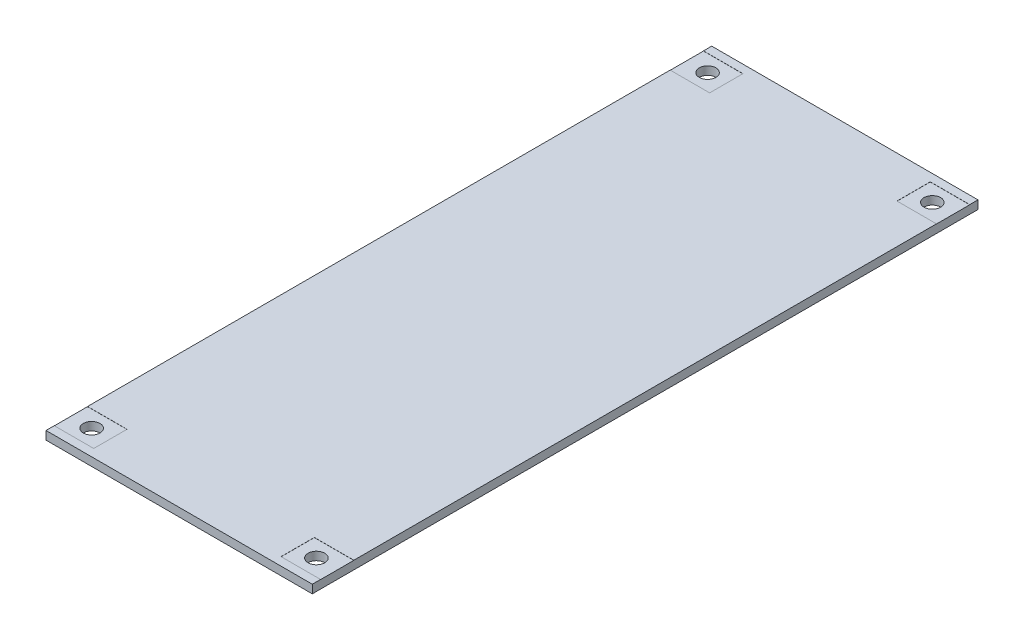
ISO-10303-21;
HEADER;
FILE_DESCRIPTION(('STEP AP214'),'2;1');
FILE_NAME('part.step','',(''),(''),'','','');
FILE_SCHEMA(('AUTOMOTIVE_DESIGN { 1 0 10303 214 1 1 1 1 }'));
ENDSEC;
DATA;
#1=APPLICATION_CONTEXT('core data for automotive mechanical design processes');
#2=APPLICATION_PROTOCOL_DEFINITION('international standard','automotive_design',2000,#1);
#3=PRODUCT_CONTEXT('',#1,'mechanical');
#4=PRODUCT('Part','Part','',(#3));
#5=PRODUCT_RELATED_PRODUCT_CATEGORY('part','',(#4));
#6=PRODUCT_DEFINITION_FORMATION('','',#4);
#7=PRODUCT_DEFINITION_CONTEXT('part definition',#1,'design');
#8=PRODUCT_DEFINITION('design','',#6,#7);
#9=PRODUCT_DEFINITION_SHAPE('','',#8);
#10=(LENGTH_UNIT() NAMED_UNIT(*) SI_UNIT(.MILLI.,.METRE.));
#11=(NAMED_UNIT(*) PLANE_ANGLE_UNIT() SI_UNIT($,.RADIAN.));
#12=(NAMED_UNIT(*) SI_UNIT($,.STERADIAN.) SOLID_ANGLE_UNIT());
#13=UNCERTAINTY_MEASURE_WITH_UNIT(LENGTH_MEASURE(1.E-05),#10,'distance_accuracy_value','');
#14=(GEOMETRIC_REPRESENTATION_CONTEXT(3) GLOBAL_UNCERTAINTY_ASSIGNED_CONTEXT((#13)) GLOBAL_UNIT_ASSIGNED_CONTEXT((#10,
#11,#12)) REPRESENTATION_CONTEXT('',''));
#15=CARTESIAN_POINT('',(0.,0.,0.));
#16=DIRECTION('',(0.,0.,1.));
#17=DIRECTION('',(1.,0.,0.));
#18=AXIS2_PLACEMENT_3D('',#15,#16,#17);
#19=CARTESIAN_POINT('',(0.,1.6002,0.));
#20=DIRECTION('',(0.,-1.,0.));
#21=DIRECTION('',(0.,0.,-1.));
#22=AXIS2_PLACEMENT_3D('',#19,#20,#21);
#23=PLANE('',#22);
#24=DIRECTION('',(0.,0.,-1.));
#25=VECTOR('',#24,1.);
#26=CARTESIAN_POINT('',(50.8,1.6002,0.));
#27=LINE('',#26,#25);
#28=CARTESIAN_POINT('',(50.8,1.6002,0.));
#29=VERTEX_POINT('',#28);
#30=CARTESIAN_POINT('',(50.7999999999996,1.6002,-1.5747999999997));
#31=VERTEX_POINT('',#30);
#32=EDGE_CURVE('E311',#29,#31,#27,.T.);
#33=ORIENTED_EDGE('',*,*,#32,.T.);
#34=DIRECTION('',(1.,0.,0.));
#35=VECTOR('',#34,1.);
#36=CARTESIAN_POINT('',(50.4063000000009,1.6002,-1.5747999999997));
#37=LINE('',#36,#35);
#38=CARTESIAN_POINT('',(43.2688999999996,1.6002,-1.5747999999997));
#39=VERTEX_POINT('',#38);
#40=EDGE_CURVE('E194',#39,#31,#37,.T.);
#41=ORIENTED_EDGE('',*,*,#40,.F.);
#42=DIRECTION('',(0.,0.,1.));
#43=VECTOR('',#42,1.);
#44=CARTESIAN_POINT('',(43.2688999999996,1.6002,-7.92479999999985));
#45=LINE('',#44,#43);
#46=CARTESIAN_POINT('',(43.2688999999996,1.6002,-7.92479999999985));
#47=VERTEX_POINT('',#46);
#48=EDGE_CURVE('E479',#47,#39,#45,.T.);
#49=ORIENTED_EDGE('',*,*,#48,.F.);
#50=DIRECTION('',(-1.,0.,0.));
#51=VECTOR('',#50,1.);
#52=CARTESIAN_POINT('',(50.4062999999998,1.6002,-7.92479999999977));
#53=LINE('',#52,#51);
#54=CARTESIAN_POINT('',(50.7999999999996,1.6002,-7.92479999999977));
#55=VERTEX_POINT('',#54);
#56=EDGE_CURVE('E396',#55,#47,#53,.T.);
#57=ORIENTED_EDGE('',*,*,#56,.F.);
#58=CARTESIAN_POINT('',(50.7999999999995,1.6002,-119.0752));
#59=VERTEX_POINT('',#58);
#60=EDGE_CURVE('E198',#55,#59,#27,.T.);
#61=ORIENTED_EDGE('',*,*,#60,.T.);
#62=DIRECTION('',(1.,0.,0.));
#63=VECTOR('',#62,1.);
#64=CARTESIAN_POINT('',(50.4063000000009,1.6002,-119.0752));
#65=LINE('',#64,#63);
#66=CARTESIAN_POINT('',(43.2688999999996,1.6002,-119.0752));
#67=VERTEX_POINT('',#66);
#68=EDGE_CURVE('E209',#67,#59,#65,.T.);
#69=ORIENTED_EDGE('',*,*,#68,.F.);
#70=DIRECTION('',(0.,0.,1.));
#71=VECTOR('',#70,1.);
#72=CARTESIAN_POINT('',(43.2688999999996,1.6002,-125.4252));
#73=LINE('',#72,#71);
#74=CARTESIAN_POINT('',(43.2688999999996,1.6002,-125.4252));
#75=VERTEX_POINT('',#74);
#76=EDGE_CURVE('E220',#75,#67,#73,.T.);
#77=ORIENTED_EDGE('',*,*,#76,.F.);
#78=DIRECTION('',(-1.,0.,0.));
#79=VECTOR('',#78,1.);
#80=CARTESIAN_POINT('',(50.4062999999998,1.6002,-125.4252));
#81=LINE('',#80,#79);
#82=CARTESIAN_POINT('',(50.7999999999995,1.6002,-125.4252));
#83=VERTEX_POINT('',#82);
#84=EDGE_CURVE('E217',#83,#75,#81,.T.);
#85=ORIENTED_EDGE('',*,*,#84,.F.);
#86=CARTESIAN_POINT('',(50.8,1.6002,-127.));
#87=VERTEX_POINT('',#86);
#88=EDGE_CURVE('E310',#83,#87,#27,.T.);
#89=ORIENTED_EDGE('',*,*,#88,.T.);
#90=DIRECTION('',(-1.,0.,0.));
#91=VECTOR('',#90,1.);
#92=CARTESIAN_POINT('',(0.,1.6002,-127.));
#93=LINE('',#92,#91);
#94=CARTESIAN_POINT('',(0.,1.6002,-127.));
#95=VERTEX_POINT('',#94);
#96=EDGE_CURVE('E314',#87,#95,#93,.T.);
#97=ORIENTED_EDGE('',*,*,#96,.T.);
#98=DIRECTION('',(0.,0.,1.));
#99=VECTOR('',#98,1.);
#100=CARTESIAN_POINT('',(0.,1.6002,0.));
#101=LINE('',#100,#99);
#102=CARTESIAN_POINT('',(4.71411104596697E-13,1.6002,-125.4252));
#103=VERTEX_POINT('',#102);
#104=EDGE_CURVE('E303',#95,#103,#101,.T.);
#105=ORIENTED_EDGE('',*,*,#104,.T.);
#106=DIRECTION('',(-1.,0.,0.));
#107=VECTOR('',#106,1.);
#108=CARTESIAN_POINT('',(0.393699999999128,1.6002,-125.4252));
#109=LINE('',#108,#107);
#110=CARTESIAN_POINT('',(7.53110000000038,1.6002,-125.4252));
#111=VERTEX_POINT('',#110);
#112=EDGE_CURVE('E235',#111,#103,#109,.T.);
#113=ORIENTED_EDGE('',*,*,#112,.F.);
#114=DIRECTION('',(0.,0.,-1.));
#115=VECTOR('',#114,1.);
#116=CARTESIAN_POINT('',(7.53110000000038,1.6002,-119.0752));
#117=LINE('',#116,#115);
#118=CARTESIAN_POINT('',(7.53110000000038,1.6002,-119.0752));
#119=VERTEX_POINT('',#118);
#120=EDGE_CURVE('E247',#119,#111,#117,.T.);
#121=ORIENTED_EDGE('',*,*,#120,.F.);
#122=DIRECTION('',(1.,0.,0.));
#123=VECTOR('',#122,1.);
#124=CARTESIAN_POINT('',(0.393700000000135,1.6002,-119.0752));
#125=LINE('',#124,#123);
#126=CARTESIAN_POINT('',(4.72170046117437E-13,1.6002,-119.0752));
#127=VERTEX_POINT('',#126);
#128=EDGE_CURVE('E244',#127,#119,#125,.T.);
#129=ORIENTED_EDGE('',*,*,#128,.F.);
#130=CARTESIAN_POINT('',(0.,1.6002,-7.9248));
#131=VERTEX_POINT('',#130);
#132=EDGE_CURVE('E307',#127,#131,#101,.T.);
#133=ORIENTED_EDGE('',*,*,#132,.T.);
#134=DIRECTION('',(-1.,0.,0.));
#135=VECTOR('',#134,1.);
#136=CARTESIAN_POINT('',(0.393700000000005,1.6002,-7.9248));
#137=LINE('',#136,#135);
#138=CARTESIAN_POINT('',(7.5311,1.6002,-7.9248));
#139=VERTEX_POINT('',#138);
#140=EDGE_CURVE('E264',#139,#131,#137,.T.);
#141=ORIENTED_EDGE('',*,*,#140,.F.);
#142=DIRECTION('',(0.,0.,-1.));
#143=VECTOR('',#142,1.);
#144=CARTESIAN_POINT('',(7.5311,1.6002,-1.5748));
#145=LINE('',#144,#143);
#146=CARTESIAN_POINT('',(7.5311,1.6002,-1.5748));
#147=VERTEX_POINT('',#146);
#148=EDGE_CURVE('E276',#147,#139,#145,.T.);
#149=ORIENTED_EDGE('',*,*,#148,.F.);
#150=DIRECTION('',(1.,0.,0.));
#151=VECTOR('',#150,1.);
#152=CARTESIAN_POINT('',(0.393700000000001,1.6002,-1.57479999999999));
#153=LINE('',#152,#151);
#154=CARTESIAN_POINT('',(0.,1.6002,-1.57479999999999));
#155=VERTEX_POINT('',#154);
#156=EDGE_CURVE('E273',#155,#147,#153,.T.);
#157=ORIENTED_EDGE('',*,*,#156,.F.);
#158=CARTESIAN_POINT('',(0.,1.6002,0.));
#159=VERTEX_POINT('',#158);
#160=EDGE_CURVE('E308',#155,#159,#101,.T.);
#161=ORIENTED_EDGE('',*,*,#160,.T.);
#162=DIRECTION('',(1.,0.,0.));
#163=VECTOR('',#162,1.);
#164=CARTESIAN_POINT('',(0.,1.6002,0.));
#165=LINE('',#164,#163);
#166=EDGE_CURVE('E306',#159,#29,#165,.T.);
#167=ORIENTED_EDGE('',*,*,#166,.T.);
#168=EDGE_LOOP('',(#33,#41,#49,#57,#61,#69,#77,#85,#89,#97,#105,#113,#121,#129,#133,#141,#149,
#157,#161,#167));
#169=FACE_BOUND('',#168,.T.);
#170=ADVANCED_FACE('F35',(#169),#23,.F.);
#171=CARTESIAN_POINT('',(0.,0.,0.));
#172=DIRECTION('',(0.,-1.,0.));
#173=DIRECTION('',(0.,0.,-1.));
#174=AXIS2_PLACEMENT_3D('',#171,#172,#173);
#175=PLANE('',#174);
#176=CARTESIAN_POINT('',(3.9624,0.,-122.2502));
#177=DIRECTION('',(0.,1.,0.));
#178=DIRECTION('',(0.,0.,1.));
#179=AXIS2_PLACEMENT_3D('',#176,#177,#178);
#180=CIRCLE('',#179,1.5875);
#181=CARTESIAN_POINT('',(3.9624,0.,-120.6627));
#182=VERTEX_POINT('',#181);
#183=EDGE_CURVE('E293',#182,#182,#180,.T.);
#184=ORIENTED_EDGE('',*,*,#183,.T.);
#185=EDGE_LOOP('',(#184));
#186=FACE_BOUND('',#185,.T.);
#187=CARTESIAN_POINT('',(3.9624,0.,-4.7498));
#188=DIRECTION('',(0.,1.,0.));
#189=DIRECTION('',(0.,0.,1.));
#190=AXIS2_PLACEMENT_3D('',#187,#188,#189);
#191=CIRCLE('',#190,1.5875);
#192=CARTESIAN_POINT('',(3.9624,0.,-3.1623));
#193=VERTEX_POINT('',#192);
#194=EDGE_CURVE('E299',#193,#193,#191,.T.);
#195=ORIENTED_EDGE('',*,*,#194,.T.);
#196=EDGE_LOOP('',(#195));
#197=FACE_BOUND('',#196,.T.);
#198=DIRECTION('',(0.,0.,1.));
#199=VECTOR('',#198,1.);
#200=CARTESIAN_POINT('',(0.,0.,0.));
#201=LINE('',#200,#199);
#202=CARTESIAN_POINT('',(0.,0.,-127.));
#203=VERTEX_POINT('',#202);
#204=CARTESIAN_POINT('',(0.,0.,0.));
#205=VERTEX_POINT('',#204);
#206=EDGE_CURVE('E302',#203,#205,#201,.T.);
#207=ORIENTED_EDGE('',*,*,#206,.F.);
#208=DIRECTION('',(-1.,0.,0.));
#209=VECTOR('',#208,1.);
#210=CARTESIAN_POINT('',(0.,0.,-127.));
#211=LINE('',#210,#209);
#212=CARTESIAN_POINT('',(50.8,0.,-127.));
#213=VERTEX_POINT('',#212);
#214=EDGE_CURVE('E323',#213,#203,#211,.T.);
#215=ORIENTED_EDGE('',*,*,#214,.F.);
#216=DIRECTION('',(0.,0.,-1.));
#217=VECTOR('',#216,1.);
#218=CARTESIAN_POINT('',(50.8,0.,0.));
#219=LINE('',#218,#217);
#220=CARTESIAN_POINT('',(50.8,0.,0.));
#221=VERTEX_POINT('',#220);
#222=EDGE_CURVE('E321',#221,#213,#219,.T.);
#223=ORIENTED_EDGE('',*,*,#222,.F.);
#224=DIRECTION('',(1.,0.,0.));
#225=VECTOR('',#224,1.);
#226=CARTESIAN_POINT('',(0.,0.,0.));
#227=LINE('',#226,#225);
#228=EDGE_CURVE('E319',#205,#221,#227,.T.);
#229=ORIENTED_EDGE('',*,*,#228,.F.);
#230=EDGE_LOOP('',(#207,#215,#223,#229));
#231=FACE_BOUND('',#230,.T.);
#232=CARTESIAN_POINT('',(46.84,0.,-4.7498));
#233=DIRECTION('',(0.,1.,0.));
#234=DIRECTION('',(0.,0.,1.));
#235=AXIS2_PLACEMENT_3D('',#232,#233,#234);
#236=CIRCLE('',#235,1.5875);
#237=CARTESIAN_POINT('',(46.84,0.,-3.1623));
#238=VERTEX_POINT('',#237);
#239=EDGE_CURVE('E296',#238,#238,#236,.T.);
#240=ORIENTED_EDGE('',*,*,#239,.T.);
#241=EDGE_LOOP('',(#240));
#242=FACE_BOUND('',#241,.T.);
#243=CARTESIAN_POINT('',(46.8376,0.,-122.2502));
#244=DIRECTION('',(0.,1.,0.));
#245=DIRECTION('',(0.,0.,1.));
#246=AXIS2_PLACEMENT_3D('',#243,#244,#245);
#247=CIRCLE('',#246,1.5875);
#248=CARTESIAN_POINT('',(46.8376,0.,-120.6627));
#249=VERTEX_POINT('',#248);
#250=EDGE_CURVE('E290',#249,#249,#247,.T.);
#251=ORIENTED_EDGE('',*,*,#250,.T.);
#252=EDGE_LOOP('',(#251));
#253=FACE_BOUND('',#252,.T.);
#254=ADVANCED_FACE('F349',(#186,#197,#231,#242,#253),#175,.T.);
#255=CARTESIAN_POINT('',(0.,1.6002,0.));
#256=DIRECTION('',(1.,0.,0.));
#257=DIRECTION('',(0.,0.,-1.));
#258=AXIS2_PLACEMENT_3D('',#255,#256,#257);
#259=PLANE('',#258);
#260=DIRECTION('',(0.,0.,1.));
#261=VECTOR('',#260,1.);
#262=CARTESIAN_POINT('',(4.71411104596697E-13,1.5748,-125.4252));
#263=LINE('',#262,#261);
#264=CARTESIAN_POINT('',(0.,1.5748,-125.4252));
#265=VERTEX_POINT('',#264);
#266=CARTESIAN_POINT('',(4.72170046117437E-13,1.5748,-119.0752));
#267=VERTEX_POINT('',#266);
#268=EDGE_CURVE('E231',#265,#267,#263,.T.);
#269=ORIENTED_EDGE('',*,*,#268,.F.);
#270=DIRECTION('',(0.,1.,0.));
#271=VECTOR('',#270,1.);
#272=CARTESIAN_POINT('',(4.71411104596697E-13,1.5748,-125.4252));
#273=LINE('',#272,#271);
#274=EDGE_CURVE('E251',#265,#103,#273,.T.);
#275=ORIENTED_EDGE('',*,*,#274,.T.);
#276=ORIENTED_EDGE('',*,*,#104,.F.);
#277=DIRECTION('',(0.,-1.,0.));
#278=VECTOR('',#277,1.);
#279=CARTESIAN_POINT('',(0.,1.6002,-127.));
#280=LINE('',#279,#278);
#281=EDGE_CURVE('E316',#95,#203,#280,.T.);
#282=ORIENTED_EDGE('',*,*,#281,.T.);
#283=ORIENTED_EDGE('',*,*,#206,.T.);
#284=DIRECTION('',(0.,-1.,0.));
#285=VECTOR('',#284,1.);
#286=CARTESIAN_POINT('',(0.,1.6002,0.));
#287=LINE('',#286,#285);
#288=EDGE_CURVE('E11',#159,#205,#287,.T.);
#289=ORIENTED_EDGE('',*,*,#288,.F.);
#290=ORIENTED_EDGE('',*,*,#160,.F.);
#291=DIRECTION('',(0.,1.,0.));
#292=VECTOR('',#291,1.);
#293=CARTESIAN_POINT('',(0.,1.5748,-1.57479999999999));
#294=LINE('',#293,#292);
#295=CARTESIAN_POINT('',(0.,1.5748,-1.57479999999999));
#296=VERTEX_POINT('',#295);
#297=EDGE_CURVE('E272',#296,#155,#294,.T.);
#298=ORIENTED_EDGE('',*,*,#297,.F.);
#299=DIRECTION('',(0.,0.,1.));
#300=VECTOR('',#299,1.);
#301=CARTESIAN_POINT('',(0.,1.5748,-7.9248));
#302=LINE('',#301,#300);
#303=CARTESIAN_POINT('',(0.,1.5748,-7.9248));
#304=VERTEX_POINT('',#303);
#305=EDGE_CURVE('E260',#304,#296,#302,.T.);
#306=ORIENTED_EDGE('',*,*,#305,.F.);
#307=DIRECTION('',(0.,1.,0.));
#308=VECTOR('',#307,1.);
#309=CARTESIAN_POINT('',(0.,1.5748,-7.9248));
#310=LINE('',#309,#308);
#311=EDGE_CURVE('E281',#304,#131,#310,.T.);
#312=ORIENTED_EDGE('',*,*,#311,.T.);
#313=ORIENTED_EDGE('',*,*,#132,.F.);
#314=DIRECTION('',(0.,1.,0.));
#315=VECTOR('',#314,1.);
#316=CARTESIAN_POINT('',(4.72170046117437E-13,1.5748,-119.0752));
#317=LINE('',#316,#315);
#318=EDGE_CURVE('E243',#267,#127,#317,.T.);
#319=ORIENTED_EDGE('',*,*,#318,.F.);
#320=EDGE_LOOP('',(#269,#275,#276,#282,#283,#289,#290,#298,#306,#312,#313,#319));
#321=FACE_BOUND('',#320,.T.);
#322=ADVANCED_FACE('F37',(#321),#259,.F.);
#323=CARTESIAN_POINT('',(0.,1.6002,0.));
#324=DIRECTION('',(0.,0.,-1.));
#325=DIRECTION('',(-1.,0.,0.));
#326=AXIS2_PLACEMENT_3D('',#323,#324,#325);
#327=PLANE('',#326);
#328=ORIENTED_EDGE('',*,*,#228,.T.);
#329=DIRECTION('',(0.,-1.,0.));
#330=VECTOR('',#329,1.);
#331=CARTESIAN_POINT('',(50.8,1.6002,0.));
#332=LINE('',#331,#330);
#333=EDGE_CURVE('E44',#29,#221,#332,.T.);
#334=ORIENTED_EDGE('',*,*,#333,.F.);
#335=ORIENTED_EDGE('',*,*,#166,.F.);
#336=ORIENTED_EDGE('',*,*,#288,.T.);
#337=EDGE_LOOP('',(#328,#334,#335,#336));
#338=FACE_BOUND('',#337,.T.);
#339=ADVANCED_FACE('F357',(#338),#327,.F.);
#340=CARTESIAN_POINT('',(50.8,1.6002,0.));
#341=DIRECTION('',(-1.,0.,0.));
#342=DIRECTION('',(0.,0.,1.));
#343=AXIS2_PLACEMENT_3D('',#340,#341,#342);
#344=PLANE('',#343);
#345=DIRECTION('',(0.,0.,-1.));
#346=VECTOR('',#345,1.);
#347=CARTESIAN_POINT('',(50.7999999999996,1.5748,-1.5747999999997));
#348=LINE('',#347,#346);
#349=CARTESIAN_POINT('',(50.8,1.5748,-1.5747999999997));
#350=VERTEX_POINT('',#349);
#351=CARTESIAN_POINT('',(50.7999999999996,1.5748,-7.92479999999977));
#352=VERTEX_POINT('',#351);
#353=EDGE_CURVE('E188',#350,#352,#348,.T.);
#354=ORIENTED_EDGE('',*,*,#353,.F.);
#355=DIRECTION('',(0.,1.,0.));
#356=VECTOR('',#355,1.);
#357=CARTESIAN_POINT('',(50.7999999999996,1.5748,-1.5747999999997));
#358=LINE('',#357,#356);
#359=EDGE_CURVE('E52',#350,#31,#358,.T.);
#360=ORIENTED_EDGE('',*,*,#359,.T.);
#361=ORIENTED_EDGE('',*,*,#32,.F.);
#362=ORIENTED_EDGE('',*,*,#333,.T.);
#363=ORIENTED_EDGE('',*,*,#222,.T.);
#364=DIRECTION('',(0.,-1.,0.));
#365=VECTOR('',#364,1.);
#366=CARTESIAN_POINT('',(50.8,1.6002,-127.));
#367=LINE('',#366,#365);
#368=EDGE_CURVE('E327',#87,#213,#367,.T.);
#369=ORIENTED_EDGE('',*,*,#368,.F.);
#370=ORIENTED_EDGE('',*,*,#88,.F.);
#371=DIRECTION('',(0.,1.,0.));
#372=VECTOR('',#371,1.);
#373=CARTESIAN_POINT('',(50.7999999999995,1.5748,-125.4252));
#374=LINE('',#373,#372);
#375=CARTESIAN_POINT('',(50.7999999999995,1.5748,-125.4252));
#376=VERTEX_POINT('',#375);
#377=EDGE_CURVE('E216',#376,#83,#374,.T.);
#378=ORIENTED_EDGE('',*,*,#377,.F.);
#379=DIRECTION('',(0.,0.,-1.));
#380=VECTOR('',#379,1.);
#381=CARTESIAN_POINT('',(50.7999999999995,1.5748,-119.0752));
#382=LINE('',#381,#380);
#383=CARTESIAN_POINT('',(50.8,1.5748,-119.0752));
#384=VERTEX_POINT('',#383);
#385=EDGE_CURVE('E205',#384,#376,#382,.T.);
#386=ORIENTED_EDGE('',*,*,#385,.F.);
#387=DIRECTION('',(0.,1.,0.));
#388=VECTOR('',#387,1.);
#389=CARTESIAN_POINT('',(50.7999999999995,1.5748,-119.0752));
#390=LINE('',#389,#388);
#391=EDGE_CURVE('E60',#384,#59,#390,.T.);
#392=ORIENTED_EDGE('',*,*,#391,.T.);
#393=ORIENTED_EDGE('',*,*,#60,.F.);
#394=DIRECTION('',(0.,1.,0.));
#395=VECTOR('',#394,1.);
#396=CARTESIAN_POINT('',(50.7999999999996,1.5748,-7.92479999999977));
#397=LINE('',#396,#395);
#398=EDGE_CURVE('E181',#352,#55,#397,.T.);
#399=ORIENTED_EDGE('',*,*,#398,.F.);
#400=EDGE_LOOP('',(#354,#360,#361,#362,#363,#369,#370,#378,#386,#392,#393,#399));
#401=FACE_BOUND('',#400,.T.);
#402=ADVANCED_FACE('F197',(#401),#344,.F.);
#403=CARTESIAN_POINT('',(0.,1.6002,-127.));
#404=DIRECTION('',(0.,0.,1.));
#405=DIRECTION('',(1.,0.,0.));
#406=AXIS2_PLACEMENT_3D('',#403,#404,#405);
#407=PLANE('',#406);
#408=ORIENTED_EDGE('',*,*,#214,.T.);
#409=ORIENTED_EDGE('',*,*,#281,.F.);
#410=ORIENTED_EDGE('',*,*,#96,.F.);
#411=ORIENTED_EDGE('',*,*,#368,.T.);
#412=EDGE_LOOP('',(#408,#409,#410,#411));
#413=FACE_BOUND('',#412,.T.);
#414=ADVANCED_FACE('F364',(#413),#407,.F.);
#415=CARTESIAN_POINT('',(3.9624,1.6002,-4.7498));
#416=DIRECTION('',(0.,-1.,0.));
#417=DIRECTION('',(0.,0.,-1.));
#418=AXIS2_PLACEMENT_3D('',#415,#416,#417);
#419=CYLINDRICAL_SURFACE('',#418,1.5875);
#420=CARTESIAN_POINT('',(3.9624,1.5748,-4.7498));
#421=DIRECTION('',(0.,-1.,0.));
#422=DIRECTION('',(0.,0.,-1.));
#423=AXIS2_PLACEMENT_3D('',#420,#421,#422);
#424=CIRCLE('',#423,1.5875);
#425=CARTESIAN_POINT('',(3.9624,1.5748,-6.3373));
#426=VERTEX_POINT('',#425);
#427=EDGE_CURVE('E284',#426,#426,#424,.T.);
#428=ORIENTED_EDGE('',*,*,#427,.F.);
#429=EDGE_LOOP('',(#428));
#430=FACE_BOUND('',#429,.T.);
#431=ORIENTED_EDGE('',*,*,#194,.F.);
#432=EDGE_LOOP('',(#431));
#433=FACE_BOUND('',#432,.T.);
#434=ADVANCED_FACE('F367',(#430,#433),#419,.F.);
#435=CARTESIAN_POINT('',(46.84,1.6002,-4.7498));
#436=DIRECTION('',(0.,-1.,0.));
#437=DIRECTION('',(0.,0.,-1.));
#438=AXIS2_PLACEMENT_3D('',#435,#436,#437);
#439=CYLINDRICAL_SURFACE('',#438,1.5875);
#440=CARTESIAN_POINT('',(46.84,1.5748,-4.7498));
#441=DIRECTION('',(0.,-1.,0.));
#442=DIRECTION('',(0.,0.,-1.));
#443=AXIS2_PLACEMENT_3D('',#440,#441,#442);
#444=CIRCLE('',#443,1.5875);
#445=CARTESIAN_POINT('',(46.84,1.5748,-6.33729999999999));
#446=VERTEX_POINT('',#445);
#447=EDGE_CURVE('E39',#446,#446,#444,.T.);
#448=ORIENTED_EDGE('',*,*,#447,.F.);
#449=EDGE_LOOP('',(#448));
#450=FACE_BOUND('',#449,.T.);
#451=ORIENTED_EDGE('',*,*,#239,.F.);
#452=EDGE_LOOP('',(#451));
#453=FACE_BOUND('',#452,.T.);
#454=ADVANCED_FACE('F449',(#450,#453),#439,.F.);
#455=CARTESIAN_POINT('',(3.9624,1.6002,-122.2502));
#456=DIRECTION('',(0.,-1.,0.));
#457=DIRECTION('',(0.,0.,-1.));
#458=AXIS2_PLACEMENT_3D('',#455,#456,#457);
#459=CYLINDRICAL_SURFACE('',#458,1.5875);
#460=CARTESIAN_POINT('',(3.9624,1.5748,-122.2502));
#461=DIRECTION('',(0.,-1.,0.));
#462=DIRECTION('',(0.,0.,-1.));
#463=AXIS2_PLACEMENT_3D('',#460,#461,#462);
#464=CIRCLE('',#463,1.5875);
#465=CARTESIAN_POINT('',(3.9624,1.5748,-123.8377));
#466=VERTEX_POINT('',#465);
#467=EDGE_CURVE('E254',#466,#466,#464,.T.);
#468=ORIENTED_EDGE('',*,*,#467,.F.);
#469=EDGE_LOOP('',(#468));
#470=FACE_BOUND('',#469,.T.);
#471=ORIENTED_EDGE('',*,*,#183,.F.);
#472=EDGE_LOOP('',(#471));
#473=FACE_BOUND('',#472,.T.);
#474=ADVANCED_FACE('F345',(#470,#473),#459,.F.);
#475=CARTESIAN_POINT('',(46.8376,1.6002,-122.2502));
#476=DIRECTION('',(0.,-1.,0.));
#477=DIRECTION('',(0.,0.,-1.));
#478=AXIS2_PLACEMENT_3D('',#475,#476,#477);
#479=CYLINDRICAL_SURFACE('',#478,1.5875);
#480=CARTESIAN_POINT('',(46.8376,1.5748,-122.2502));
#481=DIRECTION('',(0.,-1.,0.));
#482=DIRECTION('',(0.,0.,-1.));
#483=AXIS2_PLACEMENT_3D('',#480,#481,#482);
#484=CIRCLE('',#483,1.5875);
#485=CARTESIAN_POINT('',(46.8376,1.5748,-123.8377));
#486=VERTEX_POINT('',#485);
#487=EDGE_CURVE('E225',#486,#486,#484,.T.);
#488=ORIENTED_EDGE('',*,*,#487,.F.);
#489=EDGE_LOOP('',(#488));
#490=FACE_BOUND('',#489,.T.);
#491=ORIENTED_EDGE('',*,*,#250,.F.);
#492=EDGE_LOOP('',(#491));
#493=FACE_BOUND('',#492,.T.);
#494=ADVANCED_FACE('F341',(#490,#493),#479,.F.);
#495=CARTESIAN_POINT('',(0.393700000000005,1.5748,-7.9248));
#496=DIRECTION('',(0.,0.,-1.));
#497=DIRECTION('',(-1.,0.,0.));
#498=AXIS2_PLACEMENT_3D('',#495,#496,#497);
#499=PLANE('',#498);
#500=ORIENTED_EDGE('',*,*,#140,.T.);
#501=ORIENTED_EDGE('',*,*,#311,.F.);
#502=DIRECTION('',(-1.,0.,0.));
#503=VECTOR('',#502,1.);
#504=CARTESIAN_POINT('',(0.393700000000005,1.5748,-7.9248));
#505=LINE('',#504,#503);
#506=CARTESIAN_POINT('',(7.5311,1.5748,-7.9248));
#507=VERTEX_POINT('',#506);
#508=EDGE_CURVE('E269',#507,#304,#505,.T.);
#509=ORIENTED_EDGE('',*,*,#508,.F.);
#510=DIRECTION('',(0.,1.,0.));
#511=VECTOR('',#510,1.);
#512=CARTESIAN_POINT('',(7.5311,1.5748,-7.9248));
#513=LINE('',#512,#511);
#514=EDGE_CURVE('E285',#507,#139,#513,.T.);
#515=ORIENTED_EDGE('',*,*,#514,.T.);
#516=EDGE_LOOP('',(#500,#501,#509,#515));
#517=FACE_BOUND('',#516,.T.);
#518=ADVANCED_FACE('F344',(#517),#499,.F.);
#519=CARTESIAN_POINT('',(7.5311,1.5748,-1.5748));
#520=DIRECTION('',(1.,0.,0.));
#521=DIRECTION('',(0.,0.,-1.));
#522=AXIS2_PLACEMENT_3D('',#519,#520,#521);
#523=PLANE('',#522);
#524=ORIENTED_EDGE('',*,*,#148,.T.);
#525=ORIENTED_EDGE('',*,*,#514,.F.);
#526=DIRECTION('',(0.,0.,-1.));
#527=VECTOR('',#526,1.);
#528=CARTESIAN_POINT('',(7.5311,1.5748,-1.5748));
#529=LINE('',#528,#527);
#530=CARTESIAN_POINT('',(7.5311,1.5748,-1.5748));
#531=VERTEX_POINT('',#530);
#532=EDGE_CURVE('E266',#531,#507,#529,.T.);
#533=ORIENTED_EDGE('',*,*,#532,.F.);
#534=DIRECTION('',(0.,1.,0.));
#535=VECTOR('',#534,1.);
#536=CARTESIAN_POINT('',(7.5311,1.5748,-1.5748));
#537=LINE('',#536,#535);
#538=EDGE_CURVE('E287',#531,#147,#537,.T.);
#539=ORIENTED_EDGE('',*,*,#538,.T.);
#540=EDGE_LOOP('',(#524,#525,#533,#539));
#541=FACE_BOUND('',#540,.T.);
#542=ADVANCED_FACE('F439',(#541),#523,.F.);
#543=CARTESIAN_POINT('',(0.393700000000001,1.5748,-1.57479999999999));
#544=DIRECTION('',(0.,0.,1.));
#545=DIRECTION('',(1.,0.,0.));
#546=AXIS2_PLACEMENT_3D('',#543,#544,#545);
#547=PLANE('',#546);
#548=ORIENTED_EDGE('',*,*,#156,.T.);
#549=ORIENTED_EDGE('',*,*,#538,.F.);
#550=DIRECTION('',(1.,0.,0.));
#551=VECTOR('',#550,1.);
#552=CARTESIAN_POINT('',(0.393700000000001,1.5748,-1.57479999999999));
#553=LINE('',#552,#551);
#554=EDGE_CURVE('E263',#296,#531,#553,.T.);
#555=ORIENTED_EDGE('',*,*,#554,.F.);
#556=ORIENTED_EDGE('',*,*,#297,.T.);
#557=EDGE_LOOP('',(#548,#549,#555,#556));
#558=FACE_BOUND('',#557,.T.);
#559=ADVANCED_FACE('F435',(#558),#547,.F.);
#560=CARTESIAN_POINT('',(0.,1.5748,0.));
#561=DIRECTION('',(0.,-1.,0.));
#562=DIRECTION('',(0.,0.,-1.));
#563=AXIS2_PLACEMENT_3D('',#560,#561,#562);
#564=PLANE('',#563);
#565=ORIENTED_EDGE('',*,*,#427,.T.);
#566=EDGE_LOOP('',(#565));
#567=FACE_BOUND('',#566,.T.);
#568=ORIENTED_EDGE('',*,*,#305,.T.);
#569=ORIENTED_EDGE('',*,*,#554,.T.);
#570=ORIENTED_EDGE('',*,*,#532,.T.);
#571=ORIENTED_EDGE('',*,*,#508,.T.);
#572=EDGE_LOOP('',(#568,#569,#570,#571));
#573=FACE_BOUND('',#572,.T.);
#574=ADVANCED_FACE('F425',(#567,#573),#564,.F.);
#575=CARTESIAN_POINT('',(0.393699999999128,1.5748,-125.4252));
#576=DIRECTION('',(0.,0.,-1.));
#577=DIRECTION('',(-1.,0.,0.));
#578=AXIS2_PLACEMENT_3D('',#575,#576,#577);
#579=PLANE('',#578);
#580=ORIENTED_EDGE('',*,*,#112,.T.);
#581=ORIENTED_EDGE('',*,*,#274,.F.);
#582=DIRECTION('',(-1.,0.,0.));
#583=VECTOR('',#582,1.);
#584=CARTESIAN_POINT('',(0.393699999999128,1.5748,-125.4252));
#585=LINE('',#584,#583);
#586=CARTESIAN_POINT('',(7.53110000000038,1.5748,-125.4252));
#587=VERTEX_POINT('',#586);
#588=EDGE_CURVE('E240',#587,#265,#585,.T.);
#589=ORIENTED_EDGE('',*,*,#588,.F.);
#590=DIRECTION('',(0.,1.,0.));
#591=VECTOR('',#590,1.);
#592=CARTESIAN_POINT('',(7.53110000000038,1.5748,-125.4252));
#593=LINE('',#592,#591);
#594=EDGE_CURVE('E255',#587,#111,#593,.T.);
#595=ORIENTED_EDGE('',*,*,#594,.T.);
#596=EDGE_LOOP('',(#580,#581,#589,#595));
#597=FACE_BOUND('',#596,.T.);
#598=ADVANCED_FACE('F421',(#597),#579,.F.);
#599=CARTESIAN_POINT('',(7.53110000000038,1.5748,-119.0752));
#600=DIRECTION('',(1.,0.,0.));
#601=DIRECTION('',(0.,0.,-1.));
#602=AXIS2_PLACEMENT_3D('',#599,#600,#601);
#603=PLANE('',#602);
#604=ORIENTED_EDGE('',*,*,#120,.T.);
#605=ORIENTED_EDGE('',*,*,#594,.F.);
#606=DIRECTION('',(0.,0.,-1.));
#607=VECTOR('',#606,1.);
#608=CARTESIAN_POINT('',(7.53110000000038,1.5748,-119.0752));
#609=LINE('',#608,#607);
#610=CARTESIAN_POINT('',(7.53110000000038,1.5748,-119.0752));
#611=VERTEX_POINT('',#610);
#612=EDGE_CURVE('E237',#611,#587,#609,.T.);
#613=ORIENTED_EDGE('',*,*,#612,.F.);
#614=DIRECTION('',(0.,1.,0.));
#615=VECTOR('',#614,1.);
#616=CARTESIAN_POINT('',(7.53110000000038,1.5748,-119.0752));
#617=LINE('',#616,#615);
#618=EDGE_CURVE('E257',#611,#119,#617,.T.);
#619=ORIENTED_EDGE('',*,*,#618,.T.);
#620=EDGE_LOOP('',(#604,#605,#613,#619));
#621=FACE_BOUND('',#620,.T.);
#622=ADVANCED_FACE('F424',(#621),#603,.F.);
#623=CARTESIAN_POINT('',(0.393700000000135,1.5748,-119.0752));
#624=DIRECTION('',(0.,0.,1.));
#625=DIRECTION('',(1.,0.,0.));
#626=AXIS2_PLACEMENT_3D('',#623,#624,#625);
#627=PLANE('',#626);
#628=ORIENTED_EDGE('',*,*,#128,.T.);
#629=ORIENTED_EDGE('',*,*,#618,.F.);
#630=DIRECTION('',(1.,0.,0.));
#631=VECTOR('',#630,1.);
#632=CARTESIAN_POINT('',(0.393700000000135,1.5748,-119.0752));
#633=LINE('',#632,#631);
#634=EDGE_CURVE('E234',#267,#611,#633,.T.);
#635=ORIENTED_EDGE('',*,*,#634,.F.);
#636=ORIENTED_EDGE('',*,*,#318,.T.);
#637=EDGE_LOOP('',(#628,#629,#635,#636));
#638=FACE_BOUND('',#637,.T.);
#639=ADVANCED_FACE('F419',(#638),#627,.F.);
#640=CARTESIAN_POINT('',(0.,1.5748,0.));
#641=DIRECTION('',(0.,-1.,0.));
#642=DIRECTION('',(0.,0.,-1.));
#643=AXIS2_PLACEMENT_3D('',#640,#641,#642);
#644=PLANE('',#643);
#645=ORIENTED_EDGE('',*,*,#467,.T.);
#646=EDGE_LOOP('',(#645));
#647=FACE_BOUND('',#646,.T.);
#648=ORIENTED_EDGE('',*,*,#268,.T.);
#649=ORIENTED_EDGE('',*,*,#634,.T.);
#650=ORIENTED_EDGE('',*,*,#612,.T.);
#651=ORIENTED_EDGE('',*,*,#588,.T.);
#652=EDGE_LOOP('',(#648,#649,#650,#651));
#653=FACE_BOUND('',#652,.T.);
#654=ADVANCED_FACE('F416',(#647,#653),#644,.F.);
#655=CARTESIAN_POINT('',(50.4063000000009,1.5748,-119.0752));
#656=DIRECTION('',(0.,0.,1.));
#657=DIRECTION('',(1.,0.,0.));
#658=AXIS2_PLACEMENT_3D('',#655,#656,#657);
#659=PLANE('',#658);
#660=ORIENTED_EDGE('',*,*,#68,.T.);
#661=ORIENTED_EDGE('',*,*,#391,.F.);
#662=DIRECTION('',(1.,0.,0.));
#663=VECTOR('',#662,1.);
#664=CARTESIAN_POINT('',(50.4063000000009,1.5748,-119.0752));
#665=LINE('',#664,#663);
#666=CARTESIAN_POINT('',(43.2688999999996,1.5748,-119.0752));
#667=VERTEX_POINT('',#666);
#668=EDGE_CURVE('E214',#667,#384,#665,.T.);
#669=ORIENTED_EDGE('',*,*,#668,.F.);
#670=DIRECTION('',(0.,1.,0.));
#671=VECTOR('',#670,1.);
#672=CARTESIAN_POINT('',(43.2688999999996,1.5748,-119.0752));
#673=LINE('',#672,#671);
#674=EDGE_CURVE('E226',#667,#67,#673,.T.);
#675=ORIENTED_EDGE('',*,*,#674,.T.);
#676=EDGE_LOOP('',(#660,#661,#669,#675));
#677=FACE_BOUND('',#676,.T.);
#678=ADVANCED_FACE('F397',(#677),#659,.F.);
#679=CARTESIAN_POINT('',(43.2688999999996,1.5748,-125.4252));
#680=DIRECTION('',(-1.,0.,0.));
#681=DIRECTION('',(0.,0.,1.));
#682=AXIS2_PLACEMENT_3D('',#679,#680,#681);
#683=PLANE('',#682);
#684=ORIENTED_EDGE('',*,*,#76,.T.);
#685=ORIENTED_EDGE('',*,*,#674,.F.);
#686=DIRECTION('',(0.,0.,1.));
#687=VECTOR('',#686,1.);
#688=CARTESIAN_POINT('',(43.2688999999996,1.5748,-125.4252));
#689=LINE('',#688,#687);
#690=CARTESIAN_POINT('',(43.2688999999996,1.5748,-125.4252));
#691=VERTEX_POINT('',#690);
#692=EDGE_CURVE('E211',#691,#667,#689,.T.);
#693=ORIENTED_EDGE('',*,*,#692,.F.);
#694=DIRECTION('',(0.,1.,0.));
#695=VECTOR('',#694,1.);
#696=CARTESIAN_POINT('',(43.2688999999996,1.5748,-125.4252));
#697=LINE('',#696,#695);
#698=EDGE_CURVE('E228',#691,#75,#697,.T.);
#699=ORIENTED_EDGE('',*,*,#698,.T.);
#700=EDGE_LOOP('',(#684,#685,#693,#699));
#701=FACE_BOUND('',#700,.T.);
#702=ADVANCED_FACE('F402',(#701),#683,.F.);
#703=CARTESIAN_POINT('',(50.4062999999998,1.5748,-125.4252));
#704=DIRECTION('',(0.,0.,-1.));
#705=DIRECTION('',(-1.,0.,0.));
#706=AXIS2_PLACEMENT_3D('',#703,#704,#705);
#707=PLANE('',#706);
#708=ORIENTED_EDGE('',*,*,#84,.T.);
#709=ORIENTED_EDGE('',*,*,#698,.F.);
#710=DIRECTION('',(-1.,0.,0.));
#711=VECTOR('',#710,1.);
#712=CARTESIAN_POINT('',(50.4062999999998,1.5748,-125.4252));
#713=LINE('',#712,#711);
#714=EDGE_CURVE('E208',#376,#691,#713,.T.);
#715=ORIENTED_EDGE('',*,*,#714,.F.);
#716=ORIENTED_EDGE('',*,*,#377,.T.);
#717=EDGE_LOOP('',(#708,#709,#715,#716));
#718=FACE_BOUND('',#717,.T.);
#719=ADVANCED_FACE('F404',(#718),#707,.F.);
#720=CARTESIAN_POINT('',(0.,1.5748,0.));
#721=DIRECTION('',(0.,-1.,0.));
#722=DIRECTION('',(0.,0.,-1.));
#723=AXIS2_PLACEMENT_3D('',#720,#721,#722);
#724=PLANE('',#723);
#725=ORIENTED_EDGE('',*,*,#487,.T.);
#726=EDGE_LOOP('',(#725));
#727=FACE_BOUND('',#726,.T.);
#728=ORIENTED_EDGE('',*,*,#385,.T.);
#729=ORIENTED_EDGE('',*,*,#714,.T.);
#730=ORIENTED_EDGE('',*,*,#692,.T.);
#731=ORIENTED_EDGE('',*,*,#668,.T.);
#732=EDGE_LOOP('',(#728,#729,#730,#731));
#733=FACE_BOUND('',#732,.T.);
#734=ADVANCED_FACE('F338',(#727,#733),#724,.F.);
#735=CARTESIAN_POINT('',(50.4063000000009,1.5748,-1.5747999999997));
#736=DIRECTION('',(0.,0.,1.));
#737=DIRECTION('',(1.,0.,0.));
#738=AXIS2_PLACEMENT_3D('',#735,#736,#737);
#739=PLANE('',#738);
#740=ORIENTED_EDGE('',*,*,#40,.T.);
#741=ORIENTED_EDGE('',*,*,#359,.F.);
#742=DIRECTION('',(1.,0.,0.));
#743=VECTOR('',#742,1.);
#744=CARTESIAN_POINT('',(50.4063000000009,1.5748,-1.5747999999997));
#745=LINE('',#744,#743);
#746=CARTESIAN_POINT('',(43.2688999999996,1.5748,-1.5747999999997));
#747=VERTEX_POINT('',#746);
#748=EDGE_CURVE('E192',#747,#350,#745,.T.);
#749=ORIENTED_EDGE('',*,*,#748,.F.);
#750=DIRECTION('',(0.,1.,0.));
#751=VECTOR('',#750,1.);
#752=CARTESIAN_POINT('',(43.2688999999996,1.5748,-1.5747999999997));
#753=LINE('',#752,#751);
#754=EDGE_CURVE('E200',#747,#39,#753,.T.);
#755=ORIENTED_EDGE('',*,*,#754,.T.);
#756=EDGE_LOOP('',(#740,#741,#749,#755));
#757=FACE_BOUND('',#756,.T.);
#758=ADVANCED_FACE('F411',(#757),#739,.F.);
#759=CARTESIAN_POINT('',(43.2688999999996,1.5748,-7.92479999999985));
#760=DIRECTION('',(-1.,0.,0.));
#761=DIRECTION('',(0.,0.,1.));
#762=AXIS2_PLACEMENT_3D('',#759,#760,#761);
#763=PLANE('',#762);
#764=ORIENTED_EDGE('',*,*,#48,.T.);
#765=ORIENTED_EDGE('',*,*,#754,.F.);
#766=DIRECTION('',(0.,0.,1.));
#767=VECTOR('',#766,1.);
#768=CARTESIAN_POINT('',(43.2688999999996,1.5748,-7.92479999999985));
#769=LINE('',#768,#767);
#770=CARTESIAN_POINT('',(43.2688999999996,1.5748,-7.92479999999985));
#771=VERTEX_POINT('',#770);
#772=EDGE_CURVE('E187',#771,#747,#769,.T.);
#773=ORIENTED_EDGE('',*,*,#772,.F.);
#774=DIRECTION('',(0.,1.,0.));
#775=VECTOR('',#774,1.);
#776=CARTESIAN_POINT('',(43.2688999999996,1.5748,-7.92479999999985));
#777=LINE('',#776,#775);
#778=EDGE_CURVE('E183',#771,#47,#777,.T.);
#779=ORIENTED_EDGE('',*,*,#778,.T.);
#780=EDGE_LOOP('',(#764,#765,#773,#779));
#781=FACE_BOUND('',#780,.T.);
#782=ADVANCED_FACE('F485',(#781),#763,.F.);
#783=CARTESIAN_POINT('',(50.4062999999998,1.5748,-7.92479999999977));
#784=DIRECTION('',(0.,0.,-1.));
#785=DIRECTION('',(-1.,0.,0.));
#786=AXIS2_PLACEMENT_3D('',#783,#784,#785);
#787=PLANE('',#786);
#788=ORIENTED_EDGE('',*,*,#56,.T.);
#789=ORIENTED_EDGE('',*,*,#778,.F.);
#790=DIRECTION('',(-1.,0.,0.));
#791=VECTOR('',#790,1.);
#792=CARTESIAN_POINT('',(50.4062999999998,1.5748,-7.92479999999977));
#793=LINE('',#792,#791);
#794=EDGE_CURVE('E176',#352,#771,#793,.T.);
#795=ORIENTED_EDGE('',*,*,#794,.F.);
#796=ORIENTED_EDGE('',*,*,#398,.T.);
#797=EDGE_LOOP('',(#788,#789,#795,#796));
#798=FACE_BOUND('',#797,.T.);
#799=ADVANCED_FACE('F179',(#798),#787,.F.);
#800=CARTESIAN_POINT('',(0.,1.5748,0.));
#801=DIRECTION('',(0.,-1.,0.));
#802=DIRECTION('',(0.,0.,-1.));
#803=AXIS2_PLACEMENT_3D('',#800,#801,#802);
#804=PLANE('',#803);
#805=ORIENTED_EDGE('',*,*,#447,.T.);
#806=EDGE_LOOP('',(#805));
#807=FACE_BOUND('',#806,.T.);
#808=ORIENTED_EDGE('',*,*,#353,.T.);
#809=ORIENTED_EDGE('',*,*,#794,.T.);
#810=ORIENTED_EDGE('',*,*,#772,.T.);
#811=ORIENTED_EDGE('',*,*,#748,.T.);
#812=EDGE_LOOP('',(#808,#809,#810,#811));
#813=FACE_BOUND('',#812,.T.);
#814=ADVANCED_FACE('F191',(#807,#813),#804,.F.);
#815=CLOSED_SHELL('',(#170,#254,#322,#339,#402,#414,#434,#454,#474,#494,#518,#542,#559,#574,
#598,#622,#639,#654,#678,#702,#719,#734,#758,#782,#799,#814));
#816=MANIFOLD_SOLID_BREP('B2',#815);
#817=ADVANCED_BREP_SHAPE_REPRESENTATION('',(#18,#816),#14);
#818=SHAPE_DEFINITION_REPRESENTATION(#9,#817);
ENDSEC;
END-ISO-10303-21;
